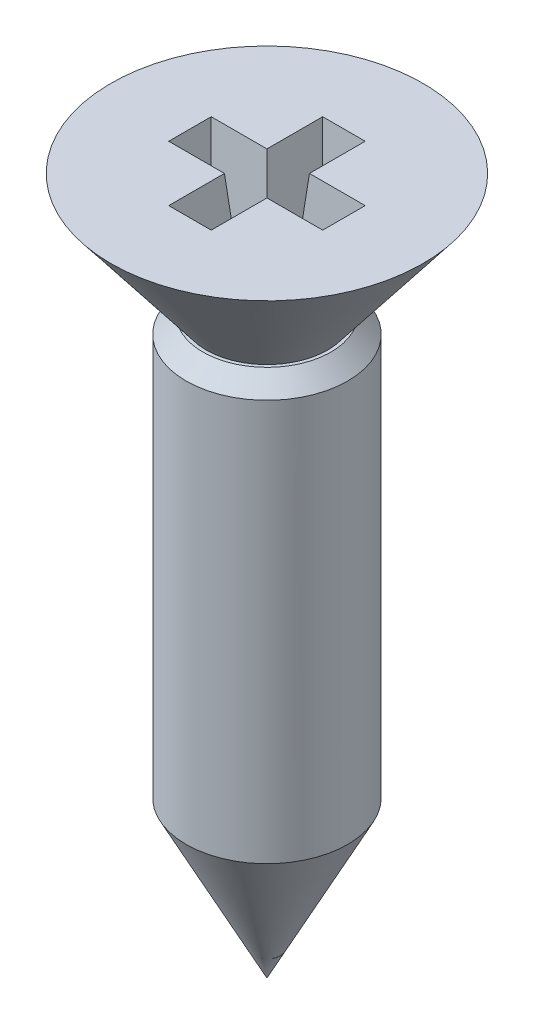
from build123d import *

# Parameters (mm, degrees)
CHANFREIN2_SIZE         = 0.3
ENL_V_MAT_EXTRU_1_DEPTH = 1.5
D_POUILLE1_ANGLE        = 5


with BuildPart() as part:
    # Esquisse1 → R_volution1 (revolve)
    with BuildSketch(Plane.XY, mode=Mode.PRIVATE) as r_volution1_sk:
        Polygon((0, -3.448239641), (2.8, -3.448239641), (1.09, -5.648239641), (1.45, -5.648239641), (1.45, -13.148239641), (0, -15.948239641), align=None)
    revolve(r_volution1_sk.sketch.rotate(Axis((0, 0, 0), (0, -1, 0)), 90), axis=Axis((0, 0, 0), (0, -1, 0)))

    # Chanfrein2
    chanfrein2_edges = [part.edges().sort_by_distance(p)[0] for p in [
        (0, -5.648239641, -1.45),
    ]]
    chamfer(chanfrein2_edges, length=CHANFREIN2_SIZE)

    # Esquisse2 → Enl_v. mat.-Extru.1 (cut)
    with BuildSketch(Plane(origin=(0, -3.448239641, 0), x_dir=(-1, 0, 0), z_dir=(0, 1, 0))):
        Polygon((0.25, -1.25), (-0.25, -1.25), (-0.25, -0.25), (-1.25, -0.25), (-1.25, 0.25), (-0.25, 0.25), (-0.25, 1.25), (0.25, 1.25), (0.25, 0.25), (1.25, 0.25), (1.25, -0.25), (0.25, -0.25), align=None)
    extrude(amount=-ENL_V_MAT_EXTRU_1_DEPTH, mode=Mode.SUBTRACT)

    # D_pouille1
    d_pouille1_faces = [part.faces().sort_by_distance(p)[0] for p in [
        (0.25, -4.198239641, 0.75),
        (1.25, -4.198239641, 0),
        (0.25, -4.198239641, -0.75),
        (-0.25, -4.198239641, 0.75),
        (-0.25, -4.198239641, -0.75),
        (-1.25, -4.198239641, 0),
        (0, -4.198239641, 1.25),
        (-0.75, -4.198239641, 0.25),
        (0.75, -4.198239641, 0.25),
        (0, -4.198239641, -1.25),
        (0.75, -4.198239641, -0.25),
        (-0.75, -4.198239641, -0.25),
    ]]
    draft(d_pouille1_faces, Plane(origin=(-0.25, -4.948239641, 0.25), x_dir=(0, 0, 1), z_dir=(0, 1, 0)), D_POUILLE1_ANGLE)


solid = part.part
